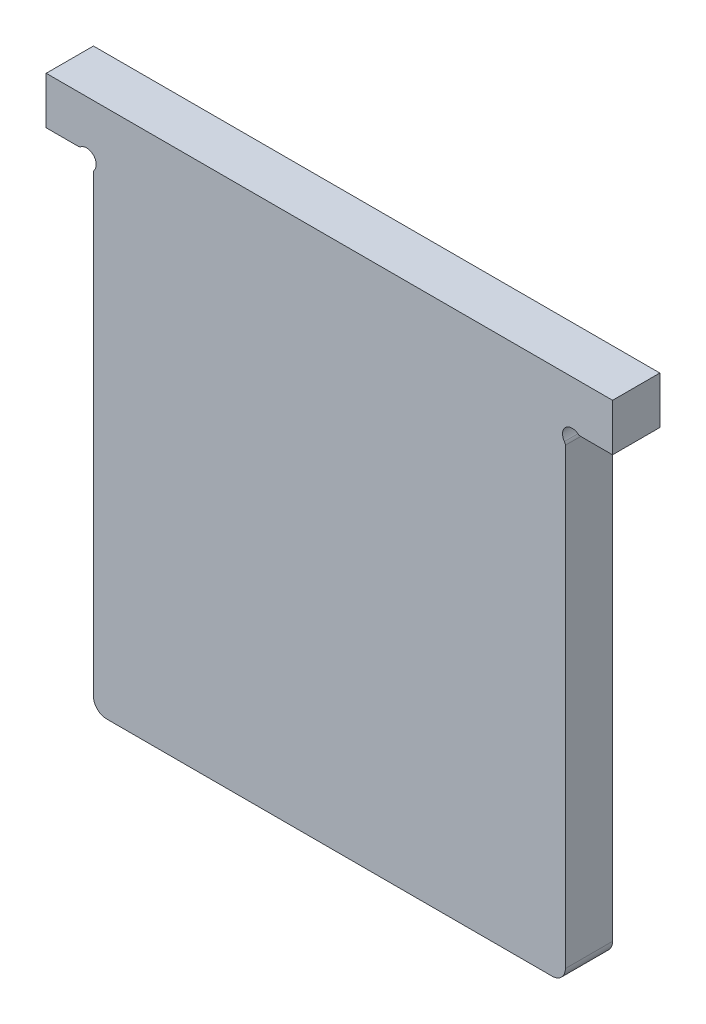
from build123d import *

# Parameters (mm, degrees)
BOSS_EXTRUDE1_DEPTH = 25
FILLET1_R           = 7


with BuildPart() as part:
    # Sketch1 → Boss-Extrude1 (new body)
    with BuildSketch(Plane.XY):
        with BuildLine():
            Line((149.9, 280), (149.9, 255))
            Line((149.9, 255), (133.031040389, 255))
            ThreePointArc((133.031040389, 255), (132.247325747, 255.126017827), (131.542620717, 255.491366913))
            ThreePointArc((131.542620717, 255.491366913), (124.9, 255), (124.408633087, 248.357379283))
            ThreePointArc((124.408633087, 248.357379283), (124.773982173, 247.652674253), (124.9, 246.868959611))
            Line((124.9, 246.868959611), (124.9, 0))
            Line((124.9, 0), (0, 0))
            Line((0, 0), (0, 280))
            Line((0, 280), (149.9, 280))
        make_face()
    extrude(amount=BOSS_EXTRUDE1_DEPTH)

    # Fillet1
    fillet1_edges = [part.edges().sort_by_distance(p)[0] for p in [
        (124.9, 0, 12.5),
    ]]
    fillet(fillet1_edges, radius=FILLET1_R)

    # Sym_trie1: part across plane


with BuildPart() as part_1:
    add(part.part)
    add(part.part.mirror(Plane(origin=(0, 0, 25), x_dir=(0, 0, 1), z_dir=(-1, 0, 0))))


solid = part_1.part
